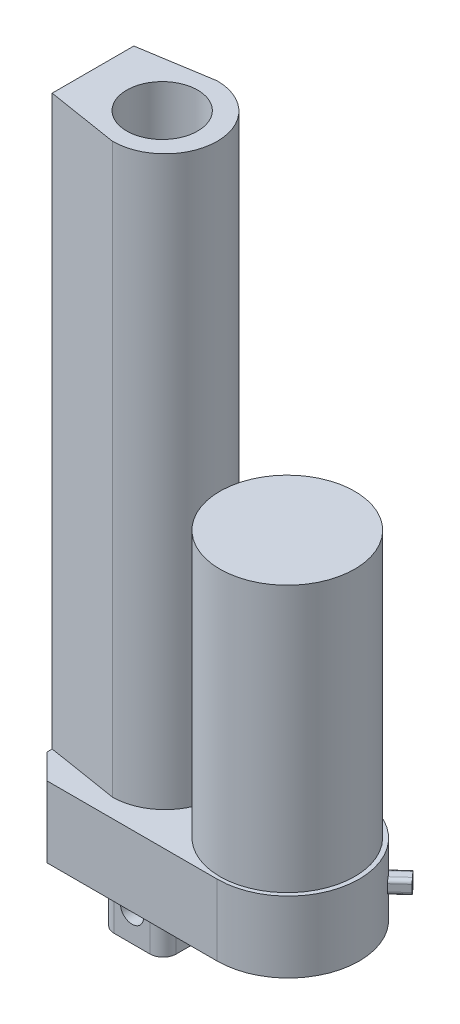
ISO-10303-21;
HEADER;
FILE_DESCRIPTION(('STEP AP214'),'2;1');
FILE_NAME('part.step','',(''),(''),'','','');
FILE_SCHEMA(('AUTOMOTIVE_DESIGN { 1 0 10303 214 1 1 1 1 }'));
ENDSEC;
DATA;
#1=APPLICATION_CONTEXT('core data for automotive mechanical design processes');
#2=APPLICATION_PROTOCOL_DEFINITION('international standard','automotive_design',2000,#1);
#3=PRODUCT_CONTEXT('',#1,'mechanical');
#4=PRODUCT('Part','Part','',(#3));
#5=PRODUCT_RELATED_PRODUCT_CATEGORY('part','',(#4));
#6=PRODUCT_DEFINITION_FORMATION('','',#4);
#7=PRODUCT_DEFINITION_CONTEXT('part definition',#1,'design');
#8=PRODUCT_DEFINITION('design','',#6,#7);
#9=PRODUCT_DEFINITION_SHAPE('','',#8);
#10=(LENGTH_UNIT() NAMED_UNIT(*) SI_UNIT(.MILLI.,.METRE.));
#11=(NAMED_UNIT(*) PLANE_ANGLE_UNIT() SI_UNIT($,.RADIAN.));
#12=(NAMED_UNIT(*) SI_UNIT($,.STERADIAN.) SOLID_ANGLE_UNIT());
#13=UNCERTAINTY_MEASURE_WITH_UNIT(LENGTH_MEASURE(1.E-05),#10,'distance_accuracy_value','');
#14=(GEOMETRIC_REPRESENTATION_CONTEXT(3) GLOBAL_UNCERTAINTY_ASSIGNED_CONTEXT((#13)) GLOBAL_UNIT_ASSIGNED_CONTEXT((#10,
#11,#12)) REPRESENTATION_CONTEXT('',''));
#15=CARTESIAN_POINT('',(0.,0.,0.));
#16=DIRECTION('',(0.,0.,1.));
#17=DIRECTION('',(1.,0.,0.));
#18=AXIS2_PLACEMENT_3D('',#15,#16,#17);
#19=CARTESIAN_POINT('',(55.,20.,-20.));
#20=DIRECTION('',(0.,-1.,0.));
#21=DIRECTION('',(0.,0.,-1.));
#22=AXIS2_PLACEMENT_3D('',#19,#20,#21);
#23=CYLINDRICAL_SURFACE('',#22,20.);
#24=CARTESIAN_POINT('',(55.,0.,-20.));
#25=DIRECTION('',(0.,1.,0.));
#26=DIRECTION('',(0.,0.,1.));
#27=AXIS2_PLACEMENT_3D('',#24,#25,#26);
#28=CIRCLE('',#27,20.);
#29=CARTESIAN_POINT('',(55.,0.,0.));
#30=VERTEX_POINT('',#29);
#31=CARTESIAN_POINT('',(55.,0.,-40.));
#32=VERTEX_POINT('',#31);
#33=EDGE_CURVE('E327',#30,#32,#28,.T.);
#34=ORIENTED_EDGE('',*,*,#33,.T.);
#35=DIRECTION('',(0.,-1.,0.));
#36=VECTOR('',#35,1.);
#37=CARTESIAN_POINT('',(55.,20.,-40.));
#38=LINE('',#37,#36);
#39=CARTESIAN_POINT('',(55.,20.,-40.));
#40=VERTEX_POINT('',#39);
#41=EDGE_CURVE('E324',#40,#32,#38,.T.);
#42=ORIENTED_EDGE('',*,*,#41,.F.);
#43=CARTESIAN_POINT('',(55.,20.,-20.));
#44=DIRECTION('',(0.,1.,0.));
#45=DIRECTION('',(0.,0.,1.));
#46=AXIS2_PLACEMENT_3D('',#43,#44,#45);
#47=CIRCLE('',#46,20.);
#48=CARTESIAN_POINT('',(55.,20.,0.));
#49=VERTEX_POINT('',#48);
#50=EDGE_CURVE('E319',#49,#40,#47,.T.);
#51=ORIENTED_EDGE('',*,*,#50,.F.);
#52=DIRECTION('',(0.,-1.,0.));
#53=VECTOR('',#52,1.);
#54=CARTESIAN_POINT('',(55.,20.,0.));
#55=LINE('',#54,#53);
#56=EDGE_CURVE('E334',#49,#30,#55,.T.);
#57=ORIENTED_EDGE('',*,*,#56,.T.);
#58=EDGE_LOOP('',(#34,#42,#51,#57));
#59=FACE_BOUND('',#58,.T.);
#60=CARTESIAN_POINT('',(55.,12.,-20.));
#61=DIRECTION('',(0.,-1.,0.));
#62=DIRECTION('',(0.,0.,-1.));
#63=AXIS2_PLACEMENT_3D('',#60,#61,#62);
#64=CIRCLE('',#63,20.);
#65=CARTESIAN_POINT('',(69.1313133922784,12.,-34.1529495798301));
#66=VERTEX_POINT('',#65);
#67=CARTESIAN_POINT('',(70.474181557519,12.,-32.6708210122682));
#68=VERTEX_POINT('',#67);
#69=EDGE_CURVE('E381',#66,#68,#64,.T.);
#70=ORIENTED_EDGE('',*,*,#69,.F.);
#71=CARTESIAN_POINT('',(69.1313133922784,12.,-34.1529495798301));
#72=CARTESIAN_POINT('',(69.1113420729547,11.9999998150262,-34.1728908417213));
#73=CARTESIAN_POINT('',(69.0913376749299,11.9988074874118,-34.1927796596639));
#74=CARTESIAN_POINT('',(69.0513893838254,11.9940523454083,-34.232330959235));
#75=CARTESIAN_POINT('',(69.0314454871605,11.9904896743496,-34.2519934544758));
#76=CARTESIAN_POINT('',(68.9719583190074,11.9762827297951,-34.3103967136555));
#77=CARTESIAN_POINT('',(68.9326908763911,11.962119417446,-34.3486218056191));
#78=CARTESIAN_POINT('',(68.8561268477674,11.9248103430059,-34.4225722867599));
#79=CARTESIAN_POINT('',(68.8188310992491,11.9016607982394,-34.4582966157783));
#80=CARTESIAN_POINT('',(68.7473256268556,11.8470378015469,-34.5263028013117));
#81=CARTESIAN_POINT('',(68.7131154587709,11.8155655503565,-34.5585851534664));
#82=CARTESIAN_POINT('',(68.6487945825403,11.7451423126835,-34.6189040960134));
#83=CARTESIAN_POINT('',(68.6186884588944,11.7061830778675,-34.6469359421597));
#84=CARTESIAN_POINT('',(68.5635602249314,11.6218937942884,-34.6980015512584));
#85=CARTESIAN_POINT('',(68.538539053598,11.576562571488,-34.7210343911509));
#86=CARTESIAN_POINT('',(68.4944266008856,11.4808890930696,-34.7614819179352));
#87=CARTESIAN_POINT('',(68.4753270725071,11.4305539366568,-34.778904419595));
#88=CARTESIAN_POINT('',(68.4436466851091,11.3262554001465,-34.8077285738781));
#89=CARTESIAN_POINT('',(68.4310616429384,11.2722943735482,-34.8191340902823));
#90=CARTESIAN_POINT('',(68.4160243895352,11.1816560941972,-34.8327459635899));
#91=CARTESIAN_POINT('',(68.4115658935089,11.1455626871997,-34.8367761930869));
#92=CARTESIAN_POINT('',(68.4056160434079,11.0729847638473,-34.8421515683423));
#93=CARTESIAN_POINT('',(68.40412059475,11.0365008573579,-34.843500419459));
#94=CARTESIAN_POINT('',(68.4041248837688,11.,-34.8434981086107));
#95=B_SPLINE_CURVE_WITH_KNOTS('',3,(#71,#72,#73,#74,#75,#76,#77,#78,#79,#80,#81,#82,#83,#84,#85,
#86,#87,#88,#89,#90,#91,#92,#93,#94),.UNSPECIFIED.,.F.,.F.,(4,2,2,2,2,2,2,2,2,2,2,4),(0.,
0.0846151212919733,0.169225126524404,0.33815770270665,0.507161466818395,0.676140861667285,
0.845307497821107,1.01450534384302,1.18346648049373,1.35231898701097,1.46188461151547,
1.57129872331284),.UNSPECIFIED.);
#96=CARTESIAN_POINT('',(68.4041248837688,11.,-34.8434981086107));
#97=VERTEX_POINT('',#96);
#98=EDGE_CURVE('E452',#66,#97,#95,.T.);
#99=ORIENTED_EDGE('',*,*,#98,.T.);
#100=DIRECTION('',(0.,-1.,0.));
#101=VECTOR('',#100,1.);
#102=CARTESIAN_POINT('',(68.4041248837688,20.,-34.8434981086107));
#103=LINE('',#102,#101);
#104=CARTESIAN_POINT('',(68.4041248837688,9.,-34.8434981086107));
#105=VERTEX_POINT('',#104);
#106=EDGE_CURVE('E377',#97,#105,#103,.T.);
#107=ORIENTED_EDGE('',*,*,#106,.T.);
#108=CARTESIAN_POINT('',(68.4041248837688,9.,-34.8434981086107));
#109=CARTESIAN_POINT('',(68.4041247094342,8.97195315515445,-34.8434978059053));
#110=CARTESIAN_POINT('',(68.4050055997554,8.94391979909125,-34.8427028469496));
#111=CARTESIAN_POINT('',(68.4085177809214,8.88805478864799,-34.8395302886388));
#112=CARTESIAN_POINT('',(68.4111489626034,8.86022312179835,-34.8371527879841));
#113=CARTESIAN_POINT('',(68.4216377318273,8.77738843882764,-34.8276678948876));
#114=CARTESIAN_POINT('',(68.4320906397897,8.72294202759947,-34.8182080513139));
#115=CARTESIAN_POINT('',(68.4595768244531,8.61719293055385,-34.7932461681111));
#116=CARTESIAN_POINT('',(68.4766128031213,8.56589154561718,-34.7777416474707));
#117=CARTESIAN_POINT('',(68.5167067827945,8.46786786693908,-34.7410777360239));
#118=CARTESIAN_POINT('',(68.5397640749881,8.42114503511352,-34.7199190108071));
#119=CARTESIAN_POINT('',(68.5912344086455,8.33346219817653,-34.6724085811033));
#120=CARTESIAN_POINT('',(68.6196620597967,8.29251845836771,-34.6460427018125));
#121=CARTESIAN_POINT('',(68.6809460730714,8.21767837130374,-34.5888131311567));
#122=CARTESIAN_POINT('',(68.7138033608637,8.18378350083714,-34.5579484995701));
#123=CARTESIAN_POINT('',(68.783071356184,8.12387627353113,-34.4923850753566));
#124=CARTESIAN_POINT('',(68.8194959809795,8.0978965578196,-34.4576711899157));
#125=CARTESIAN_POINT('',(68.8946796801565,8.05475181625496,-34.3854296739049));
#126=CARTESIAN_POINT('',(68.9334373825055,8.03758166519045,-34.3479036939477));
#127=CARTESIAN_POINT('',(68.9989152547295,8.01673468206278,-34.2839668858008));
#128=CARTESIAN_POINT('',(69.0253167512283,8.01046427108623,-34.2580455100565));
#129=CARTESIAN_POINT('',(69.0782715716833,8.00209722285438,-34.2057617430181));
#130=CARTESIAN_POINT('',(69.1048246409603,7.99999493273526,-34.1793999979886));
#131=CARTESIAN_POINT('',(69.1313133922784,8.,-34.1529495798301));
#132=B_SPLINE_CURVE_WITH_KNOTS('',3,(#108,#109,#110,#111,#112,#113,#114,#115,#116,#117,#118,
#119,#120,#121,#122,#123,#124,#125,#126,#127,#128,#129,#130,#131),.UNSPECIFIED.,.F.,.F.,(4,2,2,
2,2,2,2,2,2,2,2,4),(0.,0.0840886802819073,0.168172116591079,0.336031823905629,0.503960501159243,
0.671869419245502,0.840241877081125,1.00864957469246,1.17774264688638,1.34673723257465,
1.45909845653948,1.5713071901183),.UNSPECIFIED.);
#133=CARTESIAN_POINT('',(69.1313133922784,8.,-34.1529495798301));
#134=VERTEX_POINT('',#133);
#135=EDGE_CURVE('E421',#105,#134,#132,.T.);
#136=ORIENTED_EDGE('',*,*,#135,.T.);
#137=CARTESIAN_POINT('',(55.,8.,-20.));
#138=DIRECTION('',(0.,-1.,0.));
#139=DIRECTION('',(0.,0.,-1.));
#140=AXIS2_PLACEMENT_3D('',#137,#138,#139);
#141=CIRCLE('',#140,20.);
#142=CARTESIAN_POINT('',(70.474181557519,8.,-32.6708210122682));
#143=VERTEX_POINT('',#142);
#144=EDGE_CURVE('E374',#134,#143,#141,.T.);
#145=ORIENTED_EDGE('',*,*,#144,.T.);
#146=CARTESIAN_POINT('',(70.474181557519,8.,-32.6708210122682));
#147=CARTESIAN_POINT('',(70.4920619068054,8.00000018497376,-32.648985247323));
#148=CARTESIAN_POINT('',(70.5098868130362,8.00119251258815,-32.6271217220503));
#149=CARTESIAN_POINT('',(70.54531733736,8.00594765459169,-32.5834771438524));
#150=CARTESIAN_POINT('',(70.5629229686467,8.00951032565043,-32.5616960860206));
#151=CARTESIAN_POINT('',(70.6151923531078,8.02371727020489,-32.496753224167));
#152=CARTESIAN_POINT('',(70.6493700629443,8.037880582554,-32.4539166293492));
#153=CARTESIAN_POINT('',(70.7154317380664,8.0751896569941,-32.3704505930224));
#154=CARTESIAN_POINT('',(70.7473147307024,8.09833920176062,-32.3298220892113));
#155=CARTESIAN_POINT('',(70.8079584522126,8.15296219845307,-32.2519747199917));
#156=CARTESIAN_POINT('',(70.8367196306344,8.18443444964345,-32.21475536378));
#157=CARTESIAN_POINT('',(70.8904200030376,8.25485768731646,-32.1448138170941));
#158=CARTESIAN_POINT('',(70.9153549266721,8.29381692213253,-32.1120966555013));
#159=CARTESIAN_POINT('',(70.9607509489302,8.37810620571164,-32.0522132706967));
#160=CARTESIAN_POINT('',(70.9812112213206,8.42343742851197,-32.0250480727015));
#161=CARTESIAN_POINT('',(71.0171240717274,8.51911090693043,-31.977171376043));
#162=CARTESIAN_POINT('',(71.0325836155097,8.56944606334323,-31.9564509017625));
#163=CARTESIAN_POINT('',(71.0581521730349,8.67374459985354,-31.9220891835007));
#164=CARTESIAN_POINT('',(71.0682646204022,8.72770562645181,-31.908443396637));
#165=CARTESIAN_POINT('',(71.080331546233,8.81834390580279,-31.8921402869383));
#166=CARTESIAN_POINT('',(71.0839037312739,8.85443731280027,-31.8873070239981));
#167=CARTESIAN_POINT('',(71.0886678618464,8.92701523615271,-31.8808573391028));
#168=CARTESIAN_POINT('',(71.0898630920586,8.96349914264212,-31.879236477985));
#169=CARTESIAN_POINT('',(71.0898612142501,9.,-31.8792409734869));
#170=B_SPLINE_CURVE_WITH_KNOTS('',3,(#146,#147,#148,#149,#150,#151,#152,#153,#154,#155,#156,
#157,#158,#159,#160,#161,#162,#163,#164,#165,#166,#167,#168,#169),.UNSPECIFIED.,.F.,.F.,(4,2,2,
2,2,2,2,2,2,2,2,4),(0.,0.0846151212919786,0.169225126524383,0.338157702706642,0.507161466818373,
0.676140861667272,0.845307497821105,1.01450534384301,1.18346648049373,1.35231898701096,
1.46188461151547,1.57129872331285),.UNSPECIFIED.);
#171=CARTESIAN_POINT('',(71.0898612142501,9.,-31.8792409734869));
#172=VERTEX_POINT('',#171);
#173=EDGE_CURVE('E456',#143,#172,#170,.T.);
#174=ORIENTED_EDGE('',*,*,#173,.T.);
#175=DIRECTION('',(0.,-1.,0.));
#176=VECTOR('',#175,1.);
#177=CARTESIAN_POINT('',(71.0898612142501,20.,-31.8792409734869));
#178=LINE('',#177,#176);
#179=CARTESIAN_POINT('',(71.0898612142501,11.,-31.8792409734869));
#180=VERTEX_POINT('',#179);
#181=EDGE_CURVE('E382',#172,#180,#178,.F.);
#182=ORIENTED_EDGE('',*,*,#181,.T.);
#183=CARTESIAN_POINT('',(71.0898612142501,11.,-31.8792409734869));
#184=CARTESIAN_POINT('',(71.0898608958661,11.0280468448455,-31.8792408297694));
#185=CARTESIAN_POINT('',(71.0891564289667,11.0560802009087,-31.8801956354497));
#186=CARTESIAN_POINT('',(71.0863446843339,11.111945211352,-31.884002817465));
#187=CARTESIAN_POINT('',(71.0842374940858,11.1397768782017,-31.8868550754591));
#188=CARTESIAN_POINT('',(71.0758301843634,11.2226115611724,-31.8982258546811));
#189=CARTESIAN_POINT('',(71.0674442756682,11.2770579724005,-31.9095584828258));
#190=CARTESIAN_POINT('',(71.0453067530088,11.3828070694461,-31.9393664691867));
#191=CARTESIAN_POINT('',(71.0315529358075,11.4341084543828,-31.9578447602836));
#192=CARTESIAN_POINT('',(70.9990101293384,11.5321321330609,-32.0013503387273));
#193=CARTESIAN_POINT('',(70.9802217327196,11.5788549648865,-32.0263768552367));
#194=CARTESIAN_POINT('',(70.9380038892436,11.6665378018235,-32.0822704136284));
#195=CARTESIAN_POINT('',(70.9145617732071,11.7074815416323,-32.1131533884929));
#196=CARTESIAN_POINT('',(70.8636371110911,11.7823216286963,-32.1797689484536));
#197=CARTESIAN_POINT('',(70.8361537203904,11.8162164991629,-32.2155025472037));
#198=CARTESIAN_POINT('',(70.7777208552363,11.8761237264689,-32.2908830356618));
#199=CARTESIAN_POINT('',(70.7467577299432,11.9021034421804,-32.330545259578));
#200=CARTESIAN_POINT('',(70.6822609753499,11.945248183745,-32.4124695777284));
#201=CARTESIAN_POINT('',(70.6487288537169,11.9624183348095,-32.4547301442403));
#202=CARTESIAN_POINT('',(70.5915419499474,11.9832653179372,-32.5261789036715));
#203=CARTESIAN_POINT('',(70.5683429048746,11.9895357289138,-32.5550018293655));
#204=CARTESIAN_POINT('',(70.5215208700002,11.9979027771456,-32.6128421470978));
#205=CARTESIAN_POINT('',(70.4978984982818,12.0000050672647,-32.6418592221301));
#206=CARTESIAN_POINT('',(70.474181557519,12.,-32.6708210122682));
#207=B_SPLINE_CURVE_WITH_KNOTS('',3,(#183,#184,#185,#186,#187,#188,#189,#190,#191,#192,#193,
#194,#195,#196,#197,#198,#199,#200,#201,#202,#203,#204,#205,#206),.UNSPECIFIED.,.F.,.F.,(4,2,2,
2,2,2,2,2,2,2,2,4),(0.,0.0840886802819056,0.168172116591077,0.33603182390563,0.503960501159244,
0.671869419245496,0.840241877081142,1.00864957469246,1.17774264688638,1.34673723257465,
1.45909845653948,1.57130719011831),.UNSPECIFIED.);
#208=EDGE_CURVE('E413',#180,#68,#207,.T.);
#209=ORIENTED_EDGE('',*,*,#208,.T.);
#210=EDGE_LOOP('',(#70,#99,#107,#136,#145,#174,#182,#209));
#211=FACE_BOUND('',#210,.T.);
#212=ADVANCED_FACE('F56',(#59,#211),#23,.T.);
#213=CARTESIAN_POINT('',(55.,0.,-20.));
#214=DIRECTION('',(0.,1.,0.));
#215=DIRECTION('',(0.,0.,1.));
#216=AXIS2_PLACEMENT_3D('',#213,#214,#215);
#217=PLANE('',#216);
#218=DIRECTION('',(1.,0.,0.));
#219=VECTOR('',#218,1.);
#220=CARTESIAN_POINT('',(0.,0.,0.));
#221=LINE('',#220,#219);
#222=CARTESIAN_POINT('',(7.00000000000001,0.,0.));
#223=VERTEX_POINT('',#222);
#224=EDGE_CURVE('E325',#223,#30,#221,.T.);
#225=ORIENTED_EDGE('',*,*,#224,.F.);
#226=DIRECTION('',(0.707106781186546,0.,0.707106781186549));
#227=VECTOR('',#226,1.);
#228=CARTESIAN_POINT('',(7.00000000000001,0.,0.));
#229=LINE('',#228,#227);
#230=CARTESIAN_POINT('',(0.,0.,-7.00000000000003));
#231=VERTEX_POINT('',#230);
#232=EDGE_CURVE('E468',#223,#231,#229,.F.);
#233=ORIENTED_EDGE('',*,*,#232,.T.);
#234=DIRECTION('',(0.,0.,1.));
#235=VECTOR('',#234,1.);
#236=CARTESIAN_POINT('',(0.,0.,0.));
#237=LINE('',#236,#235);
#238=CARTESIAN_POINT('',(0.,0.,-33.));
#239=VERTEX_POINT('',#238);
#240=EDGE_CURVE('E314',#239,#231,#237,.T.);
#241=ORIENTED_EDGE('',*,*,#240,.F.);
#242=DIRECTION('',(-0.707106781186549,0.,0.707106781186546));
#243=VECTOR('',#242,1.);
#244=CARTESIAN_POINT('',(0.,0.,-33.));
#245=LINE('',#244,#243);
#246=CARTESIAN_POINT('',(7.00000000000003,0.,-40.));
#247=VERTEX_POINT('',#246);
#248=EDGE_CURVE('E466',#239,#247,#245,.F.);
#249=ORIENTED_EDGE('',*,*,#248,.T.);
#250=DIRECTION('',(-1.,0.,0.));
#251=VECTOR('',#250,1.);
#252=CARTESIAN_POINT('',(0.,0.,-40.));
#253=LINE('',#252,#251);
#254=EDGE_CURVE('E329',#32,#247,#253,.T.);
#255=ORIENTED_EDGE('',*,*,#254,.F.);
#256=ORIENTED_EDGE('',*,*,#33,.F.);
#257=EDGE_LOOP('',(#225,#233,#241,#249,#255,#256));
#258=FACE_BOUND('',#257,.T.);
#259=DIRECTION('',(0.,0.,-1.));
#260=VECTOR('',#259,1.);
#261=CARTESIAN_POINT('',(11.,0.,-28.75));
#262=LINE('',#261,#260);
#263=CARTESIAN_POINT('',(11.,0.,-14.95));
#264=VERTEX_POINT('',#263);
#265=CARTESIAN_POINT('',(11.,0.,-25.05));
#266=VERTEX_POINT('',#265);
#267=EDGE_CURVE('E279',#264,#266,#262,.T.);
#268=ORIENTED_EDGE('',*,*,#267,.F.);
#269=CARTESIAN_POINT('',(14.7,0.,-14.95));
#270=DIRECTION('',(0.,1.,0.));
#271=DIRECTION('',(0.,0.,1.));
#272=AXIS2_PLACEMENT_3D('',#269,#270,#271);
#273=CIRCLE('',#272,3.7);
#274=CARTESIAN_POINT('',(14.7,0.,-11.25));
#275=VERTEX_POINT('',#274);
#276=EDGE_CURVE('E367',#264,#275,#273,.T.);
#277=ORIENTED_EDGE('',*,*,#276,.T.);
#278=DIRECTION('',(-1.,0.,0.));
#279=VECTOR('',#278,1.);
#280=CARTESIAN_POINT('',(28.5,0.,-11.25));
#281=LINE('',#280,#279);
#282=CARTESIAN_POINT('',(24.8,0.,-11.25));
#283=VERTEX_POINT('',#282);
#284=EDGE_CURVE('E285',#283,#275,#281,.T.);
#285=ORIENTED_EDGE('',*,*,#284,.F.);
#286=CARTESIAN_POINT('',(24.8,0.,-14.95));
#287=DIRECTION('',(0.,1.,0.));
#288=DIRECTION('',(0.,0.,1.));
#289=AXIS2_PLACEMENT_3D('',#286,#287,#288);
#290=CIRCLE('',#289,3.7);
#291=CARTESIAN_POINT('',(28.5,0.,-14.95));
#292=VERTEX_POINT('',#291);
#293=EDGE_CURVE('E373',#283,#292,#290,.T.);
#294=ORIENTED_EDGE('',*,*,#293,.T.);
#295=DIRECTION('',(0.,0.,1.));
#296=VECTOR('',#295,1.);
#297=CARTESIAN_POINT('',(28.5,0.,-28.75));
#298=LINE('',#297,#296);
#299=CARTESIAN_POINT('',(28.5,0.,-25.05));
#300=VERTEX_POINT('',#299);
#301=EDGE_CURVE('E300',#300,#292,#298,.T.);
#302=ORIENTED_EDGE('',*,*,#301,.F.);
#303=CARTESIAN_POINT('',(24.8,0.,-25.05));
#304=DIRECTION('',(0.,1.,0.));
#305=DIRECTION('',(0.,0.,1.));
#306=AXIS2_PLACEMENT_3D('',#303,#304,#305);
#307=CIRCLE('',#306,3.7);
#308=CARTESIAN_POINT('',(24.8,0.,-28.75));
#309=VERTEX_POINT('',#308);
#310=EDGE_CURVE('E371',#300,#309,#307,.T.);
#311=ORIENTED_EDGE('',*,*,#310,.T.);
#312=DIRECTION('',(1.,0.,0.));
#313=VECTOR('',#312,1.);
#314=CARTESIAN_POINT('',(28.5,0.,-28.75));
#315=LINE('',#314,#313);
#316=CARTESIAN_POINT('',(14.7,0.,-28.75));
#317=VERTEX_POINT('',#316);
#318=EDGE_CURVE('E295',#317,#309,#315,.T.);
#319=ORIENTED_EDGE('',*,*,#318,.F.);
#320=CARTESIAN_POINT('',(14.7,0.,-25.05));
#321=DIRECTION('',(0.,1.,0.));
#322=DIRECTION('',(0.,0.,1.));
#323=AXIS2_PLACEMENT_3D('',#320,#321,#322);
#324=CIRCLE('',#323,3.7);
#325=EDGE_CURVE('E370',#317,#266,#324,.T.);
#326=ORIENTED_EDGE('',*,*,#325,.T.);
#327=EDGE_LOOP('',(#268,#277,#285,#294,#302,#311,#319,#326));
#328=FACE_BOUND('',#327,.T.);
#329=ADVANCED_FACE('F489',(#258,#328),#217,.F.);
#330=CARTESIAN_POINT('',(0.,20.,0.));
#331=DIRECTION('',(1.,0.,0.));
#332=DIRECTION('',(0.,0.,-1.));
#333=AXIS2_PLACEMENT_3D('',#330,#331,#332);
#334=PLANE('',#333);
#335=ORIENTED_EDGE('',*,*,#240,.T.);
#336=DIRECTION('',(0.,1.,0.));
#337=VECTOR('',#336,1.);
#338=CARTESIAN_POINT('',(0.,20.,-7.00000000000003));
#339=LINE('',#338,#337);
#340=CARTESIAN_POINT('',(0.,20.,-7.00000000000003));
#341=VERTEX_POINT('',#340);
#342=EDGE_CURVE('E475',#231,#341,#339,.T.);
#343=ORIENTED_EDGE('',*,*,#342,.T.);
#344=DIRECTION('',(0.,0.,1.));
#345=VECTOR('',#344,1.);
#346=CARTESIAN_POINT('',(0.,20.,0.));
#347=LINE('',#346,#345);
#348=CARTESIAN_POINT('',(0.,20.,-8.49999999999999));
#349=VERTEX_POINT('',#348);
#350=EDGE_CURVE('E243',#349,#341,#347,.T.);
#351=ORIENTED_EDGE('',*,*,#350,.F.);
#352=DIRECTION('',(0.,1.,0.));
#353=VECTOR('',#352,1.);
#354=CARTESIAN_POINT('',(0.,-8.28427124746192,-8.49999999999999));
#355=LINE('',#354,#353);
#356=CARTESIAN_POINT('',(0.,180.,-8.49999999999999));
#357=VERTEX_POINT('',#356);
#358=EDGE_CURVE('E269',#349,#357,#355,.T.);
#359=ORIENTED_EDGE('',*,*,#358,.T.);
#360=DIRECTION('',(0.,0.,-1.));
#361=VECTOR('',#360,1.);
#362=CARTESIAN_POINT('',(0.,180.,-5.25));
#363=LINE('',#362,#361);
#364=CARTESIAN_POINT('',(0.,180.,-31.5));
#365=VERTEX_POINT('',#364);
#366=EDGE_CURVE('E257',#357,#365,#363,.T.);
#367=ORIENTED_EDGE('',*,*,#366,.T.);
#368=DIRECTION('',(0.,1.,0.));
#369=VECTOR('',#368,1.);
#370=CARTESIAN_POINT('',(0.,-8.28427124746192,-31.5));
#371=LINE('',#370,#369);
#372=CARTESIAN_POINT('',(0.,20.,-31.5));
#373=VERTEX_POINT('',#372);
#374=EDGE_CURVE('E250',#373,#365,#371,.T.);
#375=ORIENTED_EDGE('',*,*,#374,.F.);
#376=CARTESIAN_POINT('',(0.,20.,-33.));
#377=VERTEX_POINT('',#376);
#378=EDGE_CURVE('E233',#377,#373,#347,.T.);
#379=ORIENTED_EDGE('',*,*,#378,.F.);
#380=DIRECTION('',(0.,-1.,0.));
#381=VECTOR('',#380,1.);
#382=CARTESIAN_POINT('',(0.,20.,-33.));
#383=LINE('',#382,#381);
#384=EDGE_CURVE('E474',#377,#239,#383,.T.);
#385=ORIENTED_EDGE('',*,*,#384,.T.);
#386=EDGE_LOOP('',(#335,#343,#351,#359,#367,#375,#379,#385));
#387=FACE_BOUND('',#386,.T.);
#388=ADVANCED_FACE('F253',(#387),#334,.F.);
#389=CARTESIAN_POINT('',(0.,20.,0.));
#390=DIRECTION('',(0.,0.,-1.));
#391=DIRECTION('',(-1.,0.,0.));
#392=AXIS2_PLACEMENT_3D('',#389,#390,#391);
#393=PLANE('',#392);
#394=DIRECTION('',(1.,0.,0.));
#395=VECTOR('',#394,1.);
#396=CARTESIAN_POINT('',(0.,20.,0.));
#397=LINE('',#396,#395);
#398=CARTESIAN_POINT('',(7.00000000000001,20.,0.));
#399=VERTEX_POINT('',#398);
#400=EDGE_CURVE('E245',#399,#49,#397,.T.);
#401=ORIENTED_EDGE('',*,*,#400,.F.);
#402=DIRECTION('',(0.,-1.,0.));
#403=VECTOR('',#402,1.);
#404=CARTESIAN_POINT('',(7.00000000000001,20.,0.));
#405=LINE('',#404,#403);
#406=EDGE_CURVE('E463',#399,#223,#405,.T.);
#407=ORIENTED_EDGE('',*,*,#406,.T.);
#408=ORIENTED_EDGE('',*,*,#224,.T.);
#409=ORIENTED_EDGE('',*,*,#56,.F.);
#410=EDGE_LOOP('',(#401,#407,#408,#409));
#411=FACE_BOUND('',#410,.T.);
#412=ADVANCED_FACE('F484',(#411),#393,.F.);
#413=CARTESIAN_POINT('',(0.,20.,-40.));
#414=DIRECTION('',(0.,0.,1.));
#415=DIRECTION('',(1.,0.,0.));
#416=AXIS2_PLACEMENT_3D('',#413,#414,#415);
#417=PLANE('',#416);
#418=ORIENTED_EDGE('',*,*,#254,.T.);
#419=DIRECTION('',(0.,1.,0.));
#420=VECTOR('',#419,1.);
#421=CARTESIAN_POINT('',(7.00000000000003,20.,-40.));
#422=LINE('',#421,#420);
#423=CARTESIAN_POINT('',(7.00000000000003,20.,-40.));
#424=VERTEX_POINT('',#423);
#425=EDGE_CURVE('E13',#247,#424,#422,.T.);
#426=ORIENTED_EDGE('',*,*,#425,.T.);
#427=DIRECTION('',(-1.,0.,0.));
#428=VECTOR('',#427,1.);
#429=CARTESIAN_POINT('',(0.,20.,-40.));
#430=LINE('',#429,#428);
#431=EDGE_CURVE('E318',#40,#424,#430,.T.);
#432=ORIENTED_EDGE('',*,*,#431,.F.);
#433=ORIENTED_EDGE('',*,*,#41,.T.);
#434=EDGE_LOOP('',(#418,#426,#432,#433));
#435=FACE_BOUND('',#434,.T.);
#436=ADVANCED_FACE('F492',(#435),#417,.F.);
#437=CARTESIAN_POINT('',(55.,20.,-20.));
#438=DIRECTION('',(0.,1.,0.));
#439=DIRECTION('',(0.,0.,1.));
#440=AXIS2_PLACEMENT_3D('',#437,#438,#439);
#441=PLANE('',#440);
#442=CARTESIAN_POINT('',(54.7402081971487,20.,-20.));
#443=DIRECTION('',(0.,1.,0.));
#444=DIRECTION('',(0.,0.,1.));
#445=AXIS2_PLACEMENT_3D('',#442,#443,#444);
#446=CIRCLE('',#445,19.);
#447=CARTESIAN_POINT('',(54.7402081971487,20.,-0.999999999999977));
#448=VERTEX_POINT('',#447);
#449=EDGE_CURVE('E293',#448,#448,#446,.T.);
#450=ORIENTED_EDGE('',*,*,#449,.F.);
#451=EDGE_LOOP('',(#450));
#452=FACE_BOUND('',#451,.T.);
#453=ORIENTED_EDGE('',*,*,#350,.T.);
#454=DIRECTION('',(-0.707106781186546,0.,-0.707106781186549));
#455=VECTOR('',#454,1.);
#456=CARTESIAN_POINT('',(20.9999999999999,20.,14.));
#457=LINE('',#456,#455);
#458=EDGE_CURVE('E69',#341,#399,#457,.F.);
#459=ORIENTED_EDGE('',*,*,#458,.T.);
#460=ORIENTED_EDGE('',*,*,#400,.T.);
#461=ORIENTED_EDGE('',*,*,#50,.T.);
#462=ORIENTED_EDGE('',*,*,#431,.T.);
#463=DIRECTION('',(0.707106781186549,0.,-0.707106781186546));
#464=VECTOR('',#463,1.);
#465=CARTESIAN_POINT('',(21.0000000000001,20.,-54.));
#466=LINE('',#465,#464);
#467=EDGE_CURVE('E78',#424,#377,#466,.F.);
#468=ORIENTED_EDGE('',*,*,#467,.T.);
#469=ORIENTED_EDGE('',*,*,#378,.T.);
#470=DIRECTION('',(-0.987364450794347,0.,0.158465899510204));
#471=VECTOR('',#470,1.);
#472=CARTESIAN_POINT('',(20.25,20.,-34.75));
#473=LINE('',#472,#471);
#474=CARTESIAN_POINT('',(20.25,20.,-34.75));
#475=VERTEX_POINT('',#474);
#476=EDGE_CURVE('E236',#475,#373,#473,.T.);
#477=ORIENTED_EDGE('',*,*,#476,.F.);
#478=CARTESIAN_POINT('',(20.25,20.,-20.));
#479=DIRECTION('',(0.,1.,0.));
#480=DIRECTION('',(0.,0.,1.));
#481=AXIS2_PLACEMENT_3D('',#478,#479,#480);
#482=CIRCLE('',#481,14.75);
#483=CARTESIAN_POINT('',(20.25,20.,-5.25));
#484=VERTEX_POINT('',#483);
#485=EDGE_CURVE('E310',#484,#475,#482,.T.);
#486=ORIENTED_EDGE('',*,*,#485,.F.);
#487=DIRECTION('',(0.987364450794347,0.,0.158465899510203));
#488=VECTOR('',#487,1.);
#489=CARTESIAN_POINT('',(0.,20.,-8.49999999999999));
#490=LINE('',#489,#488);
#491=EDGE_CURVE('E266',#349,#484,#490,.T.);
#492=ORIENTED_EDGE('',*,*,#491,.F.);
#493=EDGE_LOOP('',(#453,#459,#460,#461,#462,#468,#469,#477,#486,#492));
#494=FACE_BOUND('',#493,.T.);
#495=ADVANCED_FACE('F234',(#452,#494),#441,.T.);
#496=CARTESIAN_POINT('',(55.,180.,-20.));
#497=DIRECTION('',(0.,1.,0.));
#498=DIRECTION('',(0.,0.,1.));
#499=AXIS2_PLACEMENT_3D('',#496,#497,#498);
#500=PLANE('',#499);
#501=DIRECTION('',(-0.987364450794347,0.,-0.158465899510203));
#502=VECTOR('',#501,1.);
#503=CARTESIAN_POINT('',(0.,180.,-8.49999999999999));
#504=LINE('',#503,#502);
#505=CARTESIAN_POINT('',(20.25,180.,-5.25));
#506=VERTEX_POINT('',#505);
#507=EDGE_CURVE('E252',#506,#357,#504,.T.);
#508=ORIENTED_EDGE('',*,*,#507,.F.);
#509=CARTESIAN_POINT('',(20.25,180.,-20.));
#510=DIRECTION('',(0.,1.,0.));
#511=DIRECTION('',(0.,0.,1.));
#512=AXIS2_PLACEMENT_3D('',#509,#510,#511);
#513=CIRCLE('',#512,14.75);
#514=CARTESIAN_POINT('',(20.25,180.,-34.75));
#515=VERTEX_POINT('',#514);
#516=EDGE_CURVE('E307',#506,#515,#513,.T.);
#517=ORIENTED_EDGE('',*,*,#516,.T.);
#518=DIRECTION('',(0.987364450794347,0.,-0.158465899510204));
#519=VECTOR('',#518,1.);
#520=CARTESIAN_POINT('',(20.25,180.,-34.75));
#521=LINE('',#520,#519);
#522=EDGE_CURVE('E260',#365,#515,#521,.T.);
#523=ORIENTED_EDGE('',*,*,#522,.F.);
#524=ORIENTED_EDGE('',*,*,#366,.F.);
#525=EDGE_LOOP('',(#508,#517,#523,#524));
#526=FACE_BOUND('',#525,.T.);
#527=CARTESIAN_POINT('',(19.75,180.,-19.7521155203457));
#528=DIRECTION('',(0.,1.,0.));
#529=DIRECTION('',(0.,0.,1.));
#530=AXIS2_PLACEMENT_3D('',#527,#528,#529);
#531=CIRCLE('',#530,10.);
#532=CARTESIAN_POINT('',(19.75,180.,-9.75211552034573));
#533=VERTEX_POINT('',#532);
#534=EDGE_CURVE('E262',#533,#533,#531,.T.);
#535=ORIENTED_EDGE('',*,*,#534,.F.);
#536=EDGE_LOOP('',(#535));
#537=FACE_BOUND('',#536,.T.);
#538=ADVANCED_FACE('F600',(#526,#537),#500,.T.);
#539=CARTESIAN_POINT('',(20.25,401.719300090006,-20.));
#540=DIRECTION('',(0.,-1.,0.));
#541=DIRECTION('',(0.,0.,-1.));
#542=AXIS2_PLACEMENT_3D('',#539,#540,#541);
#543=CYLINDRICAL_SURFACE('',#542,14.75);
#544=DIRECTION('',(0.,-1.,0.));
#545=VECTOR('',#544,1.);
#546=CARTESIAN_POINT('',(20.25,401.719300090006,-34.75));
#547=LINE('',#546,#545);
#548=EDGE_CURVE('E249',#515,#475,#547,.T.);
#549=ORIENTED_EDGE('',*,*,#548,.F.);
#550=ORIENTED_EDGE('',*,*,#516,.F.);
#551=DIRECTION('',(0.,-1.,0.));
#552=VECTOR('',#551,1.);
#553=CARTESIAN_POINT('',(20.25,401.719300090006,-5.25));
#554=LINE('',#553,#552);
#555=EDGE_CURVE('E315',#484,#506,#554,.F.);
#556=ORIENTED_EDGE('',*,*,#555,.F.);
#557=ORIENTED_EDGE('',*,*,#485,.T.);
#558=EDGE_LOOP('',(#549,#550,#556,#557));
#559=FACE_BOUND('',#558,.T.);
#560=ADVANCED_FACE('F593',(#559),#543,.T.);
#561=CARTESIAN_POINT('',(54.7402081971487,243.740115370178,-20.));
#562=DIRECTION('',(0.,-1.,0.));
#563=DIRECTION('',(0.,0.,-1.));
#564=AXIS2_PLACEMENT_3D('',#561,#562,#563);
#565=CYLINDRICAL_SURFACE('',#564,19.);
#566=ORIENTED_EDGE('',*,*,#449,.T.);
#567=EDGE_LOOP('',(#566));
#568=FACE_BOUND('',#567,.T.);
#569=CARTESIAN_POINT('',(54.7402081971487,95.,-20.));
#570=DIRECTION('',(0.,1.,0.));
#571=DIRECTION('',(0.,0.,1.));
#572=AXIS2_PLACEMENT_3D('',#569,#570,#571);
#573=CIRCLE('',#572,19.);
#574=CARTESIAN_POINT('',(54.7402081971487,95.,-0.999999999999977));
#575=VERTEX_POINT('',#574);
#576=EDGE_CURVE('E302',#575,#575,#573,.T.);
#577=ORIENTED_EDGE('',*,*,#576,.F.);
#578=EDGE_LOOP('',(#577));
#579=FACE_BOUND('',#578,.T.);
#580=ADVANCED_FACE('F594',(#568,#579),#565,.T.);
#581=CARTESIAN_POINT('',(55.,95.,-20.));
#582=DIRECTION('',(0.,1.,0.));
#583=DIRECTION('',(0.,0.,1.));
#584=AXIS2_PLACEMENT_3D('',#581,#582,#583);
#585=PLANE('',#584);
#586=ORIENTED_EDGE('',*,*,#576,.T.);
#587=EDGE_LOOP('',(#586));
#588=FACE_BOUND('',#587,.T.);
#589=ADVANCED_FACE('F588',(#588),#585,.T.);
#590=CARTESIAN_POINT('',(11.,-19.,-28.75));
#591=DIRECTION('',(1.,0.,0.));
#592=DIRECTION('',(0.,0.,-1.));
#593=AXIS2_PLACEMENT_3D('',#590,#591,#592);
#594=PLANE('',#593);
#595=ORIENTED_EDGE('',*,*,#267,.T.);
#596=DIRECTION('',(0.,1.,0.));
#597=VECTOR('',#596,1.);
#598=CARTESIAN_POINT('',(11.,-19.,-25.05));
#599=LINE('',#598,#597);
#600=CARTESIAN_POINT('',(11.,-19.,-25.05));
#601=VERTEX_POINT('',#600);
#602=EDGE_CURVE('E350',#266,#601,#599,.F.);
#603=ORIENTED_EDGE('',*,*,#602,.T.);
#604=DIRECTION('',(0.,0.,-1.));
#605=VECTOR('',#604,1.);
#606=CARTESIAN_POINT('',(11.,-19.,-28.75));
#607=LINE('',#606,#605);
#608=CARTESIAN_POINT('',(11.,-19.,-14.95));
#609=VERTEX_POINT('',#608);
#610=EDGE_CURVE('E277',#609,#601,#607,.T.);
#611=ORIENTED_EDGE('',*,*,#610,.F.);
#612=DIRECTION('',(0.,1.,0.));
#613=VECTOR('',#612,1.);
#614=CARTESIAN_POINT('',(11.,-19.,-14.95));
#615=LINE('',#614,#613);
#616=EDGE_CURVE('E345',#609,#264,#615,.T.);
#617=ORIENTED_EDGE('',*,*,#616,.T.);
#618=EDGE_LOOP('',(#595,#603,#611,#617));
#619=FACE_BOUND('',#618,.T.);
#620=ADVANCED_FACE('F587',(#619),#594,.F.);
#621=CARTESIAN_POINT('',(28.5,-19.,-28.75));
#622=DIRECTION('',(0.,0.,1.));
#623=DIRECTION('',(1.,0.,0.));
#624=AXIS2_PLACEMENT_3D('',#621,#622,#623);
#625=PLANE('',#624);
#626=CARTESIAN_POINT('',(19.75,-11.,-28.75));
#627=DIRECTION('',(0.,0.,1.));
#628=DIRECTION('',(1.,0.,0.));
#629=AXIS2_PLACEMENT_3D('',#626,#627,#628);
#630=CIRCLE('',#629,3.25);
#631=CARTESIAN_POINT('',(23.,-11.,-28.75));
#632=VERTEX_POINT('',#631);
#633=EDGE_CURVE('E261',#632,#632,#630,.T.);
#634=ORIENTED_EDGE('',*,*,#633,.T.);
#635=EDGE_LOOP('',(#634));
#636=FACE_BOUND('',#635,.T.);
#637=DIRECTION('',(1.,0.,0.));
#638=VECTOR('',#637,1.);
#639=CARTESIAN_POINT('',(28.5,-19.,-28.75));
#640=LINE('',#639,#638);
#641=CARTESIAN_POINT('',(14.7,-19.,-28.75));
#642=VERTEX_POINT('',#641);
#643=CARTESIAN_POINT('',(24.8,-19.,-28.75));
#644=VERTEX_POINT('',#643);
#645=EDGE_CURVE('E282',#642,#644,#640,.T.);
#646=ORIENTED_EDGE('',*,*,#645,.F.);
#647=DIRECTION('',(0.,1.,0.));
#648=VECTOR('',#647,1.);
#649=CARTESIAN_POINT('',(14.7,-19.,-28.75));
#650=LINE('',#649,#648);
#651=EDGE_CURVE('E343',#642,#317,#650,.T.);
#652=ORIENTED_EDGE('',*,*,#651,.T.);
#653=ORIENTED_EDGE('',*,*,#318,.T.);
#654=DIRECTION('',(0.,1.,0.));
#655=VECTOR('',#654,1.);
#656=CARTESIAN_POINT('',(24.8,-19.,-28.75));
#657=LINE('',#656,#655);
#658=EDGE_CURVE('E333',#309,#644,#657,.F.);
#659=ORIENTED_EDGE('',*,*,#658,.T.);
#660=EDGE_LOOP('',(#646,#652,#653,#659));
#661=FACE_BOUND('',#660,.T.);
#662=ADVANCED_FACE('F584',(#636,#661),#625,.F.);
#663=CARTESIAN_POINT('',(28.5,-19.,-28.75));
#664=DIRECTION('',(-1.,0.,0.));
#665=DIRECTION('',(0.,0.,1.));
#666=AXIS2_PLACEMENT_3D('',#663,#664,#665);
#667=PLANE('',#666);
#668=DIRECTION('',(0.,0.,1.));
#669=VECTOR('',#668,1.);
#670=CARTESIAN_POINT('',(28.5,-19.,-28.75));
#671=LINE('',#670,#669);
#672=CARTESIAN_POINT('',(28.5,-19.,-25.05));
#673=VERTEX_POINT('',#672);
#674=CARTESIAN_POINT('',(28.5,-19.,-14.95));
#675=VERTEX_POINT('',#674);
#676=EDGE_CURVE('E283',#673,#675,#671,.T.);
#677=ORIENTED_EDGE('',*,*,#676,.F.);
#678=DIRECTION('',(0.,1.,0.));
#679=VECTOR('',#678,1.);
#680=CARTESIAN_POINT('',(28.5,-19.,-25.05));
#681=LINE('',#680,#679);
#682=EDGE_CURVE('E364',#673,#300,#681,.T.);
#683=ORIENTED_EDGE('',*,*,#682,.T.);
#684=ORIENTED_EDGE('',*,*,#301,.T.);
#685=DIRECTION('',(0.,1.,0.));
#686=VECTOR('',#685,1.);
#687=CARTESIAN_POINT('',(28.5,-19.,-14.95));
#688=LINE('',#687,#686);
#689=EDGE_CURVE('E365',#292,#675,#688,.F.);
#690=ORIENTED_EDGE('',*,*,#689,.T.);
#691=EDGE_LOOP('',(#677,#683,#684,#690));
#692=FACE_BOUND('',#691,.T.);
#693=ADVANCED_FACE('F579',(#692),#667,.F.);
#694=CARTESIAN_POINT('',(28.5,-19.,-11.25));
#695=DIRECTION('',(0.,0.,-1.));
#696=DIRECTION('',(-1.,0.,0.));
#697=AXIS2_PLACEMENT_3D('',#694,#695,#696);
#698=PLANE('',#697);
#699=CARTESIAN_POINT('',(19.75,-11.,-11.25));
#700=DIRECTION('',(0.,0.,-1.));
#701=DIRECTION('',(-1.,0.,0.));
#702=AXIS2_PLACEMENT_3D('',#699,#700,#701);
#703=CIRCLE('',#702,3.25);
#704=CARTESIAN_POINT('',(16.5,-11.,-11.25));
#705=VERTEX_POINT('',#704);
#706=EDGE_CURVE('E337',#705,#705,#703,.T.);
#707=ORIENTED_EDGE('',*,*,#706,.T.);
#708=EDGE_LOOP('',(#707));
#709=FACE_BOUND('',#708,.T.);
#710=ORIENTED_EDGE('',*,*,#284,.T.);
#711=DIRECTION('',(0.,1.,0.));
#712=VECTOR('',#711,1.);
#713=CARTESIAN_POINT('',(14.7,-19.,-11.25));
#714=LINE('',#713,#712);
#715=CARTESIAN_POINT('',(14.7,-19.,-11.25));
#716=VERTEX_POINT('',#715);
#717=EDGE_CURVE('E359',#275,#716,#714,.F.);
#718=ORIENTED_EDGE('',*,*,#717,.T.);
#719=DIRECTION('',(-1.,0.,0.));
#720=VECTOR('',#719,1.);
#721=CARTESIAN_POINT('',(28.5,-19.,-11.25));
#722=LINE('',#721,#720);
#723=CARTESIAN_POINT('',(24.8,-19.,-11.25));
#724=VERTEX_POINT('',#723);
#725=EDGE_CURVE('E286',#724,#716,#722,.T.);
#726=ORIENTED_EDGE('',*,*,#725,.F.);
#727=DIRECTION('',(0.,1.,0.));
#728=VECTOR('',#727,1.);
#729=CARTESIAN_POINT('',(24.8,-19.,-11.25));
#730=LINE('',#729,#728);
#731=EDGE_CURVE('E357',#724,#283,#730,.T.);
#732=ORIENTED_EDGE('',*,*,#731,.T.);
#733=EDGE_LOOP('',(#710,#718,#726,#732));
#734=FACE_BOUND('',#733,.T.);
#735=ADVANCED_FACE('F573',(#709,#734),#698,.F.);
#736=CARTESIAN_POINT('',(0.,-19.,0.));
#737=DIRECTION('',(0.,-1.,0.));
#738=DIRECTION('',(0.,0.,-1.));
#739=AXIS2_PLACEMENT_3D('',#736,#737,#738);
#740=PLANE('',#739);
#741=ORIENTED_EDGE('',*,*,#610,.T.);
#742=CARTESIAN_POINT('',(14.7,-19.,-25.05));
#743=DIRECTION('',(0.,-1.,0.));
#744=DIRECTION('',(0.,0.,-1.));
#745=AXIS2_PLACEMENT_3D('',#742,#743,#744);
#746=CIRCLE('',#745,3.7);
#747=EDGE_CURVE('E352',#601,#642,#746,.T.);
#748=ORIENTED_EDGE('',*,*,#747,.T.);
#749=ORIENTED_EDGE('',*,*,#645,.T.);
#750=CARTESIAN_POINT('',(24.8,-19.,-25.05));
#751=DIRECTION('',(0.,-1.,0.));
#752=DIRECTION('',(0.,0.,-1.));
#753=AXIS2_PLACEMENT_3D('',#750,#751,#752);
#754=CIRCLE('',#753,3.7);
#755=EDGE_CURVE('E353',#644,#673,#754,.T.);
#756=ORIENTED_EDGE('',*,*,#755,.T.);
#757=ORIENTED_EDGE('',*,*,#676,.T.);
#758=CARTESIAN_POINT('',(24.8,-19.,-14.95));
#759=DIRECTION('',(0.,-1.,0.));
#760=DIRECTION('',(0.,0.,-1.));
#761=AXIS2_PLACEMENT_3D('',#758,#759,#760);
#762=CIRCLE('',#761,3.7);
#763=EDGE_CURVE('E346',#675,#724,#762,.T.);
#764=ORIENTED_EDGE('',*,*,#763,.T.);
#765=ORIENTED_EDGE('',*,*,#725,.T.);
#766=CARTESIAN_POINT('',(14.7,-19.,-14.95));
#767=DIRECTION('',(0.,-1.,0.));
#768=DIRECTION('',(0.,0.,-1.));
#769=AXIS2_PLACEMENT_3D('',#766,#767,#768);
#770=CIRCLE('',#769,3.7);
#771=EDGE_CURVE('E351',#716,#609,#770,.T.);
#772=ORIENTED_EDGE('',*,*,#771,.T.);
#773=EDGE_LOOP('',(#741,#748,#749,#756,#757,#764,#765,#772));
#774=FACE_BOUND('',#773,.T.);
#775=ADVANCED_FACE('F561',(#774),#740,.T.);
#776=CARTESIAN_POINT('',(20.25,-8.28427124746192,-34.75));
#777=DIRECTION('',(0.158465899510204,0.,0.987364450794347));
#778=DIRECTION('',(0.987364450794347,0.,-0.158465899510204));
#779=AXIS2_PLACEMENT_3D('',#776,#777,#778);
#780=PLANE('',#779);
#781=ORIENTED_EDGE('',*,*,#476,.T.);
#782=ORIENTED_EDGE('',*,*,#374,.T.);
#783=ORIENTED_EDGE('',*,*,#522,.T.);
#784=ORIENTED_EDGE('',*,*,#548,.T.);
#785=EDGE_LOOP('',(#781,#782,#783,#784));
#786=FACE_BOUND('',#785,.T.);
#787=ADVANCED_FACE('F246',(#786),#780,.F.);
#788=CARTESIAN_POINT('',(0.,-8.28427124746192,-8.49999999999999));
#789=DIRECTION('',(0.158465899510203,0.,-0.987364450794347));
#790=DIRECTION('',(-0.987364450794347,0.,-0.158465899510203));
#791=AXIS2_PLACEMENT_3D('',#788,#789,#790);
#792=PLANE('',#791);
#793=ORIENTED_EDGE('',*,*,#491,.T.);
#794=ORIENTED_EDGE('',*,*,#555,.T.);
#795=ORIENTED_EDGE('',*,*,#507,.T.);
#796=ORIENTED_EDGE('',*,*,#358,.F.);
#797=EDGE_LOOP('',(#793,#794,#795,#796));
#798=FACE_BOUND('',#797,.T.);
#799=ADVANCED_FACE('F557',(#798),#792,.F.);
#800=CARTESIAN_POINT('',(19.75,-8.28427124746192,-19.7521155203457));
#801=DIRECTION('',(0.,1.,0.));
#802=DIRECTION('',(0.,0.,1.));
#803=AXIS2_PLACEMENT_3D('',#800,#801,#802);
#804=CYLINDRICAL_SURFACE('',#803,10.);
#805=CARTESIAN_POINT('',(19.75,20.,-19.7521155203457));
#806=DIRECTION('',(0.,1.,0.));
#807=DIRECTION('',(0.,0.,1.));
#808=AXIS2_PLACEMENT_3D('',#805,#806,#807);
#809=CIRCLE('',#808,10.);
#810=CARTESIAN_POINT('',(19.75,20.,-9.75211552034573));
#811=VERTEX_POINT('',#810);
#812=EDGE_CURVE('E274',#811,#811,#809,.F.);
#813=ORIENTED_EDGE('',*,*,#812,.T.);
#814=EDGE_LOOP('',(#813));
#815=FACE_BOUND('',#814,.T.);
#816=ORIENTED_EDGE('',*,*,#534,.T.);
#817=EDGE_LOOP('',(#816));
#818=FACE_BOUND('',#817,.T.);
#819=ADVANCED_FACE('F562',(#815,#818),#804,.F.);
#820=CARTESIAN_POINT('',(55.,20.,-20.));
#821=DIRECTION('',(0.,1.,0.));
#822=DIRECTION('',(0.,0.,1.));
#823=AXIS2_PLACEMENT_3D('',#820,#821,#822);
#824=PLANE('',#823);
#825=ORIENTED_EDGE('',*,*,#812,.F.);
#826=EDGE_LOOP('',(#825));
#827=FACE_BOUND('',#826,.T.);
#828=ADVANCED_FACE('F558',(#827),#824,.T.);
#829=CARTESIAN_POINT('',(19.75,-11.,-40.));
#830=DIRECTION('',(0.,0.,1.));
#831=DIRECTION('',(1.,0.,0.));
#832=AXIS2_PLACEMENT_3D('',#829,#830,#831);
#833=CYLINDRICAL_SURFACE('',#832,3.25);
#834=ORIENTED_EDGE('',*,*,#706,.F.);
#835=EDGE_LOOP('',(#834));
#836=FACE_BOUND('',#835,.T.);
#837=ORIENTED_EDGE('',*,*,#633,.F.);
#838=EDGE_LOOP('',(#837));
#839=FACE_BOUND('',#838,.T.);
#840=ADVANCED_FACE('F552',(#836,#839),#833,.F.);
#841=CARTESIAN_POINT('',(14.7,-19.,-25.05));
#842=DIRECTION('',(0.,1.,0.));
#843=DIRECTION('',(0.,0.,1.));
#844=AXIS2_PLACEMENT_3D('',#841,#842,#843);
#845=CYLINDRICAL_SURFACE('',#844,3.7);
#846=ORIENTED_EDGE('',*,*,#747,.F.);
#847=ORIENTED_EDGE('',*,*,#602,.F.);
#848=ORIENTED_EDGE('',*,*,#325,.F.);
#849=ORIENTED_EDGE('',*,*,#651,.F.);
#850=EDGE_LOOP('',(#846,#847,#848,#849));
#851=FACE_BOUND('',#850,.T.);
#852=ADVANCED_FACE('F554',(#851),#845,.T.);
#853=CARTESIAN_POINT('',(14.7,-19.,-14.95));
#854=DIRECTION('',(0.,1.,0.));
#855=DIRECTION('',(0.,0.,1.));
#856=AXIS2_PLACEMENT_3D('',#853,#854,#855);
#857=CYLINDRICAL_SURFACE('',#856,3.7);
#858=ORIENTED_EDGE('',*,*,#771,.F.);
#859=ORIENTED_EDGE('',*,*,#717,.F.);
#860=ORIENTED_EDGE('',*,*,#276,.F.);
#861=ORIENTED_EDGE('',*,*,#616,.F.);
#862=EDGE_LOOP('',(#858,#859,#860,#861));
#863=FACE_BOUND('',#862,.T.);
#864=ADVANCED_FACE('F625',(#863),#857,.T.);
#865=CARTESIAN_POINT('',(24.8,-19.,-25.05));
#866=DIRECTION('',(0.,1.,0.));
#867=DIRECTION('',(0.,0.,1.));
#868=AXIS2_PLACEMENT_3D('',#865,#866,#867);
#869=CYLINDRICAL_SURFACE('',#868,3.7);
#870=ORIENTED_EDGE('',*,*,#755,.F.);
#871=ORIENTED_EDGE('',*,*,#658,.F.);
#872=ORIENTED_EDGE('',*,*,#310,.F.);
#873=ORIENTED_EDGE('',*,*,#682,.F.);
#874=EDGE_LOOP('',(#870,#871,#872,#873));
#875=FACE_BOUND('',#874,.T.);
#876=ADVANCED_FACE('F622',(#875),#869,.T.);
#877=CARTESIAN_POINT('',(24.8,-19.,-14.95));
#878=DIRECTION('',(0.,1.,0.));
#879=DIRECTION('',(0.,0.,1.));
#880=AXIS2_PLACEMENT_3D('',#877,#878,#879);
#881=CYLINDRICAL_SURFACE('',#880,3.7);
#882=ORIENTED_EDGE('',*,*,#763,.F.);
#883=ORIENTED_EDGE('',*,*,#689,.F.);
#884=ORIENTED_EDGE('',*,*,#293,.F.);
#885=ORIENTED_EDGE('',*,*,#731,.F.);
#886=EDGE_LOOP('',(#882,#883,#884,#885));
#887=FACE_BOUND('',#886,.T.);
#888=ADVANCED_FACE('F439',(#887),#881,.T.);
#889=CARTESIAN_POINT('',(74.7333350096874,12.,-35.1803749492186));
#890=DIRECTION('',(0.671434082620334,0.,0.741064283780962));
#891=DIRECTION('',(0.741064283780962,0.,-0.671434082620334));
#892=AXIS2_PLACEMENT_3D('',#889,#890,#891);
#893=PLANE('',#892);
#894=DIRECTION('',(0.,-1.,0.));
#895=VECTOR('',#894,1.);
#896=CARTESIAN_POINT('',(74.7333350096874,12.,-35.1803749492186));
#897=LINE('',#896,#895);
#898=CARTESIAN_POINT('',(74.7333350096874,11.,-35.1803749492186));
#899=VERTEX_POINT('',#898);
#900=CARTESIAN_POINT('',(74.7333350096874,9.,-35.1803749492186));
#901=VERTEX_POINT('',#900);
#902=EDGE_CURVE('E339',#899,#901,#897,.T.);
#903=ORIENTED_EDGE('',*,*,#902,.F.);
#904=DIRECTION('',(-0.741064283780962,0.,0.671434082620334));
#905=VECTOR('',#904,1.);
#906=CARTESIAN_POINT('',(71.0898612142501,11.,-31.8792409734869));
#907=LINE('',#906,#905);
#908=EDGE_CURVE('E390',#899,#180,#907,.T.);
#909=ORIENTED_EDGE('',*,*,#908,.T.);
#910=ORIENTED_EDGE('',*,*,#181,.F.);
#911=DIRECTION('',(-0.741064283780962,0.,0.671434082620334));
#912=VECTOR('',#911,1.);
#913=CARTESIAN_POINT('',(74.7333350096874,9.,-35.1803749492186));
#914=LINE('',#913,#912);
#915=EDGE_CURVE('E389',#172,#901,#914,.F.);
#916=ORIENTED_EDGE('',*,*,#915,.T.);
#917=EDGE_LOOP('',(#903,#909,#910,#916));
#918=FACE_BOUND('',#917,.T.);
#919=ADVANCED_FACE('F533',(#918),#893,.T.);
#920=CARTESIAN_POINT('',(63.2612589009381,12.,-30.1838544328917));
#921=DIRECTION('',(-0.671434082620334,0.,-0.741064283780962));
#922=DIRECTION('',(-0.741064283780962,0.,0.671434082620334));
#923=AXIS2_PLACEMENT_3D('',#920,#921,#922);
#924=PLANE('',#923);
#925=DIRECTION('',(0.,-1.,0.));
#926=VECTOR('',#925,1.);
#927=CARTESIAN_POINT('',(72.047598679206,12.,-38.1446320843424));
#928=LINE('',#927,#926);
#929=CARTESIAN_POINT('',(72.047598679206,11.,-38.1446320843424));
#930=VERTEX_POINT('',#929);
#931=CARTESIAN_POINT('',(72.047598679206,9.,-38.1446320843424));
#932=VERTEX_POINT('',#931);
#933=EDGE_CURVE('E512',#930,#932,#928,.T.);
#934=ORIENTED_EDGE('',*,*,#933,.T.);
#935=DIRECTION('',(0.741064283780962,0.,-0.671434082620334));
#936=VECTOR('',#935,1.);
#937=CARTESIAN_POINT('',(63.2612589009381,9.,-30.1838544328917));
#938=LINE('',#937,#936);
#939=EDGE_CURVE('E414',#932,#105,#938,.F.);
#940=ORIENTED_EDGE('',*,*,#939,.T.);
#941=ORIENTED_EDGE('',*,*,#106,.F.);
#942=DIRECTION('',(0.741064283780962,0.,-0.671434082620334));
#943=VECTOR('',#942,1.);
#944=CARTESIAN_POINT('',(72.047598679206,11.,-38.1446320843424));
#945=LINE('',#944,#943);
#946=EDGE_CURVE('E406',#97,#930,#945,.T.);
#947=ORIENTED_EDGE('',*,*,#946,.T.);
#948=EDGE_LOOP('',(#934,#940,#941,#947));
#949=FACE_BOUND('',#948,.T.);
#950=ADVANCED_FACE('F509',(#949),#924,.T.);
#951=CARTESIAN_POINT('',(72.047598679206,12.,-38.1446320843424));
#952=DIRECTION('',(0.741064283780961,0.,-0.671434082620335));
#953=DIRECTION('',(-0.671434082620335,0.,-0.741064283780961));
#954=AXIS2_PLACEMENT_3D('',#951,#952,#953);
#955=PLANE('',#954);
#956=DIRECTION('',(0.671434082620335,0.,0.741064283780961));
#957=VECTOR('',#956,1.);
#958=CARTESIAN_POINT('',(72.047598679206,12.,-38.1446320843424));
#959=LINE('',#958,#957);
#960=CARTESIAN_POINT('',(72.7190327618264,12.,-37.4035678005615));
#961=VERTEX_POINT('',#960);
#962=CARTESIAN_POINT('',(74.061900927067,12.,-35.9214392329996));
#963=VERTEX_POINT('',#962);
#964=EDGE_CURVE('E517',#961,#963,#959,.T.);
#965=ORIENTED_EDGE('',*,*,#964,.T.);
#966=CARTESIAN_POINT('',(74.061900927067,11.,-35.9214392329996));
#967=DIRECTION('',(0.741064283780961,0.,-0.671434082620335));
#968=DIRECTION('',(-0.671434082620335,0.,-0.741064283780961));
#969=AXIS2_PLACEMENT_3D('',#966,#967,#968);
#970=CIRCLE('',#969,1.);
#971=EDGE_CURVE('E405',#963,#899,#970,.T.);
#972=ORIENTED_EDGE('',*,*,#971,.T.);
#973=ORIENTED_EDGE('',*,*,#902,.T.);
#974=CARTESIAN_POINT('',(74.061900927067,9.,-35.9214392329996));
#975=DIRECTION('',(0.741064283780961,0.,-0.671434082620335));
#976=DIRECTION('',(-0.671434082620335,0.,-0.741064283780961));
#977=AXIS2_PLACEMENT_3D('',#974,#975,#976);
#978=CIRCLE('',#977,1.);
#979=CARTESIAN_POINT('',(74.061900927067,8.,-35.9214392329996));
#980=VERTEX_POINT('',#979);
#981=EDGE_CURVE('E397',#901,#980,#978,.T.);
#982=ORIENTED_EDGE('',*,*,#981,.T.);
#983=DIRECTION('',(0.671434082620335,0.,0.741064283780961));
#984=VECTOR('',#983,1.);
#985=CARTESIAN_POINT('',(72.047598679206,8.,-38.1446320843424));
#986=LINE('',#985,#984);
#987=CARTESIAN_POINT('',(72.7190327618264,8.,-37.4035678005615));
#988=VERTEX_POINT('',#987);
#989=EDGE_CURVE('E522',#988,#980,#986,.T.);
#990=ORIENTED_EDGE('',*,*,#989,.F.);
#991=CARTESIAN_POINT('',(72.7190327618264,9.,-37.4035678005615));
#992=DIRECTION('',(0.741064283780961,0.,-0.671434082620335));
#993=DIRECTION('',(-0.671434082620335,0.,-0.741064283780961));
#994=AXIS2_PLACEMENT_3D('',#991,#992,#993);
#995=CIRCLE('',#994,1.);
#996=EDGE_CURVE('E398',#988,#932,#995,.T.);
#997=ORIENTED_EDGE('',*,*,#996,.T.);
#998=ORIENTED_EDGE('',*,*,#933,.F.);
#999=CARTESIAN_POINT('',(72.7190327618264,11.,-37.4035678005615));
#1000=DIRECTION('',(0.741064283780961,0.,-0.671434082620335));
#1001=DIRECTION('',(-0.671434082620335,0.,-0.741064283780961));
#1002=AXIS2_PLACEMENT_3D('',#999,#1000,#1001);
#1003=CIRCLE('',#1002,1.);
#1004=EDGE_CURVE('E400',#930,#961,#1003,.T.);
#1005=ORIENTED_EDGE('',*,*,#1004,.T.);
#1006=EDGE_LOOP('',(#965,#972,#973,#982,#990,#997,#998,#1005));
#1007=FACE_BOUND('',#1006,.T.);
#1008=ADVANCED_FACE('F513',(#1007),#955,.T.);
#1009=CARTESIAN_POINT('',(0.,12.,0.));
#1010=DIRECTION('',(0.,-1.,0.));
#1011=DIRECTION('',(0.,0.,-1.));
#1012=AXIS2_PLACEMENT_3D('',#1009,#1010,#1011);
#1013=PLANE('',#1012);
#1014=ORIENTED_EDGE('',*,*,#69,.T.);
#1015=DIRECTION('',(-0.741064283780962,0.,0.671434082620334));
#1016=VECTOR('',#1015,1.);
#1017=CARTESIAN_POINT('',(74.061900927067,12.,-35.9214392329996));
#1018=LINE('',#1017,#1016);
#1019=EDGE_CURVE('E391',#68,#963,#1018,.F.);
#1020=ORIENTED_EDGE('',*,*,#1019,.T.);
#1021=ORIENTED_EDGE('',*,*,#964,.F.);
#1022=DIRECTION('',(0.741064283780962,0.,-0.671434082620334));
#1023=VECTOR('',#1022,1.);
#1024=CARTESIAN_POINT('',(69.0755589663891,12.,-34.1024338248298));
#1025=LINE('',#1024,#1023);
#1026=EDGE_CURVE('E395',#961,#66,#1025,.F.);
#1027=ORIENTED_EDGE('',*,*,#1026,.T.);
#1028=EDGE_LOOP('',(#1014,#1020,#1021,#1027));
#1029=FACE_BOUND('',#1028,.T.);
#1030=ADVANCED_FACE('F537',(#1029),#1013,.F.);
#1031=CARTESIAN_POINT('',(0.,8.,0.));
#1032=DIRECTION('',(0.,-1.,0.));
#1033=DIRECTION('',(0.,0.,-1.));
#1034=AXIS2_PLACEMENT_3D('',#1031,#1032,#1033);
#1035=PLANE('',#1034);
#1036=ORIENTED_EDGE('',*,*,#144,.F.);
#1037=DIRECTION('',(0.741064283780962,0.,-0.671434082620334));
#1038=VECTOR('',#1037,1.);
#1039=CARTESIAN_POINT('',(14.1723545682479,8.,15.6420802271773));
#1040=LINE('',#1039,#1038);
#1041=EDGE_CURVE('E409',#134,#988,#1040,.T.);
#1042=ORIENTED_EDGE('',*,*,#1041,.T.);
#1043=ORIENTED_EDGE('',*,*,#989,.T.);
#1044=DIRECTION('',(-0.741064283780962,0.,0.671434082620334));
#1045=VECTOR('',#1044,1.);
#1046=CARTESIAN_POINT('',(15.5152227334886,8.,17.1242087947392));
#1047=LINE('',#1046,#1045);
#1048=EDGE_CURVE('E404',#980,#143,#1047,.T.);
#1049=ORIENTED_EDGE('',*,*,#1048,.T.);
#1050=EDGE_LOOP('',(#1036,#1042,#1043,#1049));
#1051=FACE_BOUND('',#1050,.T.);
#1052=ADVANCED_FACE('F438',(#1051),#1035,.T.);
#1053=CARTESIAN_POINT('',(74.061900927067,11.,-35.9214392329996));
#1054=DIRECTION('',(0.741064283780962,0.,-0.671434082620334));
#1055=DIRECTION('',(-0.671434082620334,0.,-0.741064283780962));
#1056=AXIS2_PLACEMENT_3D('',#1053,#1054,#1055);
#1057=CYLINDRICAL_SURFACE('',#1056,1.);
#1058=ORIENTED_EDGE('',*,*,#971,.F.);
#1059=ORIENTED_EDGE('',*,*,#1019,.F.);
#1060=ORIENTED_EDGE('',*,*,#208,.F.);
#1061=ORIENTED_EDGE('',*,*,#908,.F.);
#1062=EDGE_LOOP('',(#1058,#1059,#1060,#1061));
#1063=FACE_BOUND('',#1062,.T.);
#1064=ADVANCED_FACE('F433',(#1063),#1057,.T.);
#1065=CARTESIAN_POINT('',(14.1723545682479,9.,15.6420802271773));
#1066=DIRECTION('',(0.741064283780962,0.,-0.671434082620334));
#1067=DIRECTION('',(-0.671434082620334,0.,-0.741064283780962));
#1068=AXIS2_PLACEMENT_3D('',#1065,#1066,#1067);
#1069=CYLINDRICAL_SURFACE('',#1068,1.);
#1070=ORIENTED_EDGE('',*,*,#135,.F.);
#1071=ORIENTED_EDGE('',*,*,#939,.F.);
#1072=ORIENTED_EDGE('',*,*,#996,.F.);
#1073=ORIENTED_EDGE('',*,*,#1041,.F.);
#1074=EDGE_LOOP('',(#1070,#1071,#1072,#1073));
#1075=FACE_BOUND('',#1074,.T.);
#1076=ADVANCED_FACE('F440',(#1075),#1069,.T.);
#1077=CARTESIAN_POINT('',(63.9326929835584,11.,-29.4427901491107));
#1078=DIRECTION('',(-0.741064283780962,0.,0.671434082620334));
#1079=DIRECTION('',(0.671434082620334,0.,0.741064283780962));
#1080=AXIS2_PLACEMENT_3D('',#1077,#1078,#1079);
#1081=CYLINDRICAL_SURFACE('',#1080,1.);
#1082=ORIENTED_EDGE('',*,*,#98,.F.);
#1083=ORIENTED_EDGE('',*,*,#1026,.F.);
#1084=ORIENTED_EDGE('',*,*,#1004,.F.);
#1085=ORIENTED_EDGE('',*,*,#946,.F.);
#1086=EDGE_LOOP('',(#1082,#1083,#1084,#1085));
#1087=FACE_BOUND('',#1086,.T.);
#1088=ADVANCED_FACE('F444',(#1087),#1081,.T.);
#1089=CARTESIAN_POINT('',(15.5152227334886,9.,17.1242087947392));
#1090=DIRECTION('',(-0.741064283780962,0.,0.671434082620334));
#1091=DIRECTION('',(0.671434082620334,0.,0.741064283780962));
#1092=AXIS2_PLACEMENT_3D('',#1089,#1090,#1091);
#1093=CYLINDRICAL_SURFACE('',#1092,1.);
#1094=ORIENTED_EDGE('',*,*,#981,.F.);
#1095=ORIENTED_EDGE('',*,*,#915,.F.);
#1096=ORIENTED_EDGE('',*,*,#173,.F.);
#1097=ORIENTED_EDGE('',*,*,#1048,.F.);
#1098=EDGE_LOOP('',(#1094,#1095,#1096,#1097));
#1099=FACE_BOUND('',#1098,.T.);
#1100=ADVANCED_FACE('F448',(#1099),#1093,.T.);
#1101=CARTESIAN_POINT('',(7.00000000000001,20.,0.));
#1102=DIRECTION('',(0.707106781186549,0.,-0.707106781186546));
#1103=DIRECTION('',(0.,-1.,0.));
#1104=AXIS2_PLACEMENT_3D('',#1101,#1102,#1103);
#1105=PLANE('',#1104);
#1106=ORIENTED_EDGE('',*,*,#458,.F.);
#1107=ORIENTED_EDGE('',*,*,#342,.F.);
#1108=ORIENTED_EDGE('',*,*,#232,.F.);
#1109=ORIENTED_EDGE('',*,*,#406,.F.);
#1110=EDGE_LOOP('',(#1106,#1107,#1108,#1109));
#1111=FACE_BOUND('',#1110,.T.);
#1112=ADVANCED_FACE('F487',(#1111),#1105,.F.);
#1113=CARTESIAN_POINT('',(0.,20.,-33.));
#1114=DIRECTION('',(0.707106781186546,0.,0.707106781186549));
#1115=DIRECTION('',(0.,-1.,0.));
#1116=AXIS2_PLACEMENT_3D('',#1113,#1114,#1115);
#1117=PLANE('',#1116);
#1118=ORIENTED_EDGE('',*,*,#467,.F.);
#1119=ORIENTED_EDGE('',*,*,#425,.F.);
#1120=ORIENTED_EDGE('',*,*,#248,.F.);
#1121=ORIENTED_EDGE('',*,*,#384,.F.);
#1122=EDGE_LOOP('',(#1118,#1119,#1120,#1121));
#1123=FACE_BOUND('',#1122,.T.);
#1124=ADVANCED_FACE('F64',(#1123),#1117,.F.);
#1125=CLOSED_SHELL('',(#212,#329,#388,#412,#436,#495,#538,#560,#580,#589,#620,#662,#693,#735,
#775,#787,#799,#819,#828,#840,#852,#864,#876,#888,#919,#950,#1008,#1030,#1052,#1064,#1076,#1088,
#1100,#1112,#1124));
#1126=MANIFOLD_SOLID_BREP('B2',#1125);
#1127=ADVANCED_BREP_SHAPE_REPRESENTATION('',(#18,#1126),#14);
#1128=SHAPE_DEFINITION_REPRESENTATION(#9,#1127);
ENDSEC;
END-ISO-10303-21;
